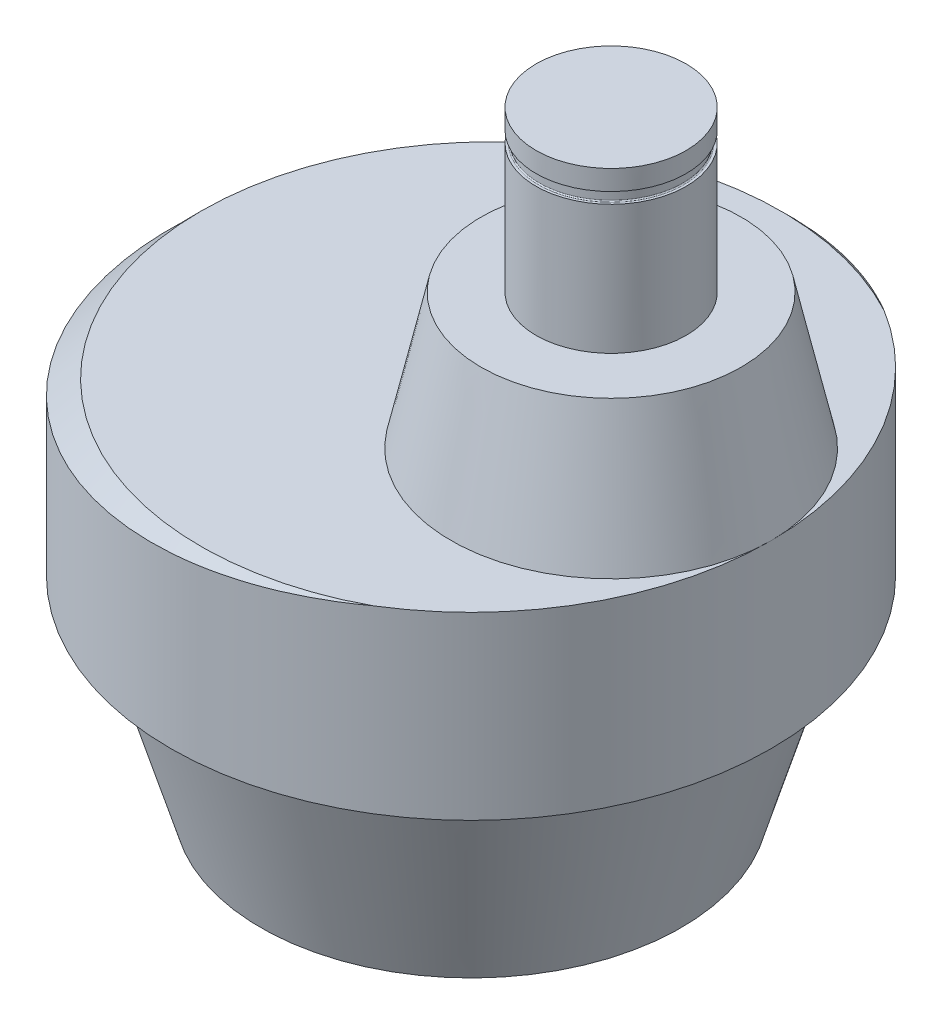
from build123d import *

# Parameters (mm, degrees)
ESQUISSE3_R                           = 13
ESQUISSE2_R                           = 16
ESQUISSE4_R                           = 7.5
EXTRUSION1_DEPTH                      = 16
DIAM_TRE_DU_PER_AGE_0_15_0_15_1_D     = 26
DIAM_TRE_DU_PER_AGE_0_15_0_15_1_DEPTH = 30
DIAM_TRE_DU_PER_AGE_0_15_0_15_1_TIP   = 7.811188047


with BuildPart() as part:
    # Esquisse1 → R_volution1 (revolve)
    with BuildSketch(Plane.XY, mode=Mode.PRIVATE) as r_volution1_sk:
        with BuildLine():
            Line((0, 38), (30, 38))
            Line((30, 38), (30, 20))
            Line((30, 20), (29.232091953, 20))
            ThreePointArc((29.232091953, 20), (27.441300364, 19.406878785), (26.358613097, 17.862043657))
            Line((26.358613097, 17.862043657), (21, 0))
            Line((21, 0), (0, 0))
            Line((0, 0), (0, 38))
        make_face()
    revolve(r_volution1_sk.sketch.rotate(Axis((0, -11.581883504, 0), (0, 1, 0)), 90), axis=Axis((0, -11.581883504, 0), (0, 1, 0)))

    # Esquisse3 → Lissage1 section 0
    with BuildSketch(Plane(origin=(0, 51.5, 0), x_dir=(-1, 0, 0), z_dir=(0, 1, 0))):
        with Locations((-14, 0)):
            Circle(ESQUISSE3_R)
    # Esquisse2 → Lissage1 section 1
    with BuildSketch(Plane(origin=(0, 38, 0), x_dir=(-1, 0, 0), z_dir=(0, 1, 0))):
        with Locations((-14, 0)):
            Circle(ESQUISSE2_R)
    loft()

    # Esquisse4 → Extrusion1 (add)
    with BuildSketch(Plane(origin=(0, 51.5, 0), x_dir=(-1, 0, 0), z_dir=(0, 1, 0))):
        with Locations(Location((-14, 0, 0), (0, 0, 90))):
            Circle(ESQUISSE4_R)
    extrude(amount=EXTRUSION1_DEPTH)

    # Esquisse9 → Enl_vement de mati_re-R_volution3 (revolve, cut)
    with BuildSketch(Plane.XY):
        Polygon((-30, 38), (-27, 38), (-30, 35), align=None)
    revolve(axis=Axis((2, 82.405677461, 0), (0, -1, 0)), mode=Mode.SUBTRACT)

    # Diam_tre du per_age _0.15 _0.15_1
    with Locations(Plane.XZ):
        with Locations((0, 0)):
            Hole(DIAM_TRE_DU_PER_AGE_0_15_0_15_1_D / 2, depth=DIAM_TRE_DU_PER_AGE_0_15_0_15_1_DEPTH)
            with Locations((0, 0, -(DIAM_TRE_DU_PER_AGE_0_15_0_15_1_DEPTH + DIAM_TRE_DU_PER_AGE_0_15_0_15_1_TIP / 2))):  # 118° drill point
                Cone(0, DIAM_TRE_DU_PER_AGE_0_15_0_15_1_D / 2, DIAM_TRE_DU_PER_AGE_0_15_0_15_1_TIP, mode=Mode.SUBTRACT)

    # Esquisse13 → Gorge pour DIN 471 - 15 x 1_ Circlips ex (revolve, cut)
    with BuildSketch(Plane(origin=(14, 67.5, 0), x_dir=(0, 0, -1), z_dir=(-1, 0, 0))):
        with BuildLine():
            Line((7.26, 2), (7.5, 2))
            Line((7.5, 2), (7.5, 3.1))
            Line((7.5, 3.1), (7.26, 3.1))
            ThreePointArc((7.26, 3.1), (7.182218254, 3.067781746), (7.15, 2.99))
            Line((7.15, 2.99), (7.15, 2.11))
            ThreePointArc((7.15, 2.11), (7.182218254, 2.032218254), (7.26, 2))
        make_face()
    revolve(axis=Axis((14, 117.558983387, 0), (0, -1, 0)), mode=Mode.SUBTRACT)


solid = part.part
